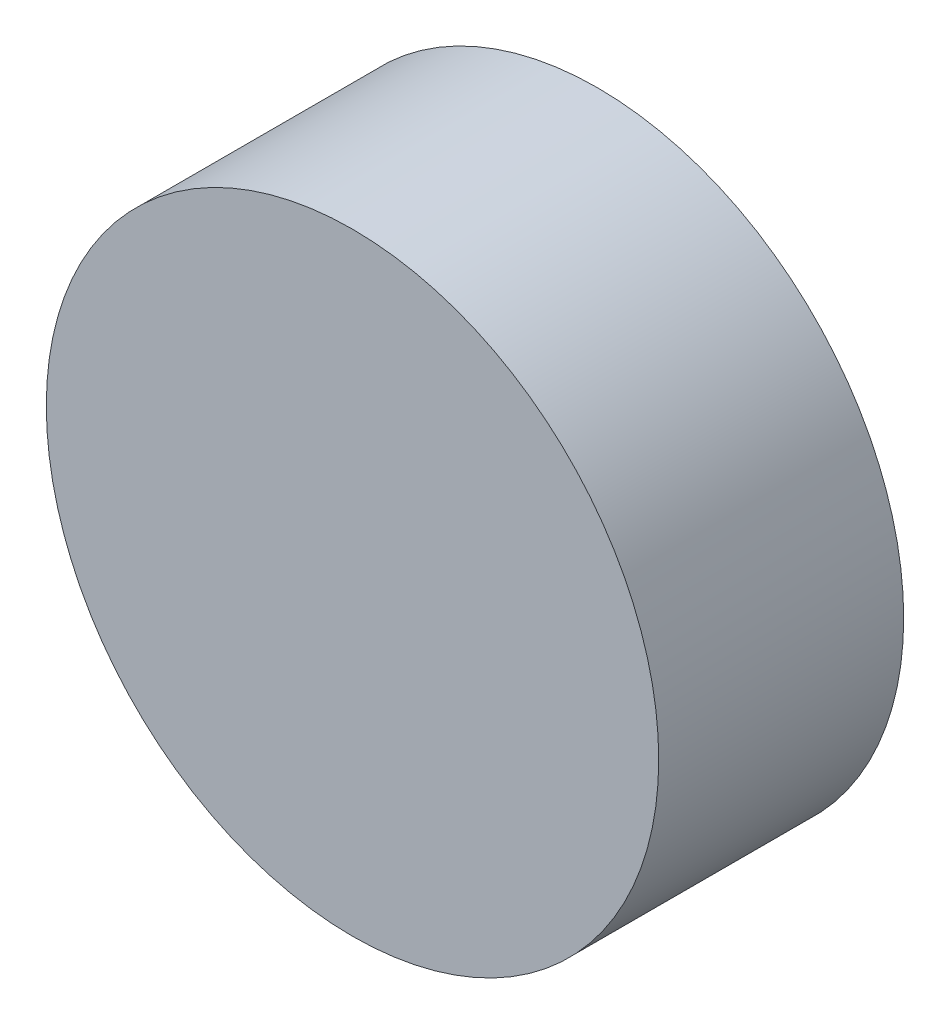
ISO-10303-21;
HEADER;
FILE_DESCRIPTION(('STEP AP214'),'2;1');
FILE_NAME('part.step','',(''),(''),'','','');
FILE_SCHEMA(('AUTOMOTIVE_DESIGN { 1 0 10303 214 1 1 1 1 }'));
ENDSEC;
DATA;
#1=APPLICATION_CONTEXT('core data for automotive mechanical design processes');
#2=APPLICATION_PROTOCOL_DEFINITION('international standard','automotive_design',2000,#1);
#3=PRODUCT_CONTEXT('',#1,'mechanical');
#4=PRODUCT('Part','Part','',(#3));
#5=PRODUCT_RELATED_PRODUCT_CATEGORY('part','',(#4));
#6=PRODUCT_DEFINITION_FORMATION('','',#4);
#7=PRODUCT_DEFINITION_CONTEXT('part definition',#1,'design');
#8=PRODUCT_DEFINITION('design','',#6,#7);
#9=PRODUCT_DEFINITION_SHAPE('','',#8);
#10=(LENGTH_UNIT() NAMED_UNIT(*) SI_UNIT(.MILLI.,.METRE.));
#11=(NAMED_UNIT(*) PLANE_ANGLE_UNIT() SI_UNIT($,.RADIAN.));
#12=(NAMED_UNIT(*) SI_UNIT($,.STERADIAN.) SOLID_ANGLE_UNIT());
#13=UNCERTAINTY_MEASURE_WITH_UNIT(LENGTH_MEASURE(1.E-05),#10,'distance_accuracy_value','');
#14=(GEOMETRIC_REPRESENTATION_CONTEXT(3) GLOBAL_UNCERTAINTY_ASSIGNED_CONTEXT((#13)) GLOBAL_UNIT_ASSIGNED_CONTEXT((#10,
#11,#12)) REPRESENTATION_CONTEXT('',''));
#15=CARTESIAN_POINT('',(0.,0.,0.));
#16=DIRECTION('',(0.,0.,1.));
#17=DIRECTION('',(1.,0.,0.));
#18=AXIS2_PLACEMENT_3D('',#15,#16,#17);
#19=CARTESIAN_POINT('',(0.,0.,-1.5));
#20=DIRECTION('',(0.,0.,1.));
#21=DIRECTION('',(1.,0.,0.));
#22=AXIS2_PLACEMENT_3D('',#19,#20,#21);
#23=CYLINDRICAL_SURFACE('',#22,3.75);
#24=CARTESIAN_POINT('',(0.,0.,-1.5));
#25=DIRECTION('',(0.,0.,1.));
#26=DIRECTION('',(1.,0.,0.));
#27=AXIS2_PLACEMENT_3D('',#24,#25,#26);
#28=CIRCLE('',#27,3.75);
#29=CARTESIAN_POINT('',(3.75,0.,-1.5));
#30=VERTEX_POINT('',#29);
#31=EDGE_CURVE('E10',#30,#30,#28,.T.);
#32=ORIENTED_EDGE('',*,*,#31,.T.);
#33=EDGE_LOOP('',(#32));
#34=FACE_BOUND('',#33,.T.);
#35=CARTESIAN_POINT('',(0.,0.,1.5));
#36=DIRECTION('',(0.,0.,1.));
#37=DIRECTION('',(1.,0.,0.));
#38=AXIS2_PLACEMENT_3D('',#35,#36,#37);
#39=CIRCLE('',#38,3.75);
#40=CARTESIAN_POINT('',(3.75,0.,1.5));
#41=VERTEX_POINT('',#40);
#42=EDGE_CURVE('E42',#41,#41,#39,.T.);
#43=ORIENTED_EDGE('',*,*,#42,.F.);
#44=EDGE_LOOP('',(#43));
#45=FACE_BOUND('',#44,.T.);
#46=ADVANCED_FACE('F39',(#34,#45),#23,.T.);
#47=CARTESIAN_POINT('',(0.,0.,-1.5));
#48=DIRECTION('',(0.,0.,1.));
#49=DIRECTION('',(1.,0.,0.));
#50=AXIS2_PLACEMENT_3D('',#47,#48,#49);
#51=PLANE('',#50);
#52=ORIENTED_EDGE('',*,*,#31,.F.);
#53=EDGE_LOOP('',(#52));
#54=FACE_BOUND('',#53,.T.);
#55=ADVANCED_FACE('F54',(#54),#51,.F.);
#56=CARTESIAN_POINT('',(0.,0.,1.5));
#57=DIRECTION('',(0.,0.,1.));
#58=DIRECTION('',(1.,0.,0.));
#59=AXIS2_PLACEMENT_3D('',#56,#57,#58);
#60=PLANE('',#59);
#61=ORIENTED_EDGE('',*,*,#42,.T.);
#62=EDGE_LOOP('',(#61));
#63=FACE_BOUND('',#62,.T.);
#64=ADVANCED_FACE('F51',(#63),#60,.T.);
#65=CLOSED_SHELL('',(#46,#55,#64));
#66=MANIFOLD_SOLID_BREP('B2',#65);
#67=ADVANCED_BREP_SHAPE_REPRESENTATION('',(#18,#66),#14);
#68=SHAPE_DEFINITION_REPRESENTATION(#9,#67);
ENDSEC;
END-ISO-10303-21;
